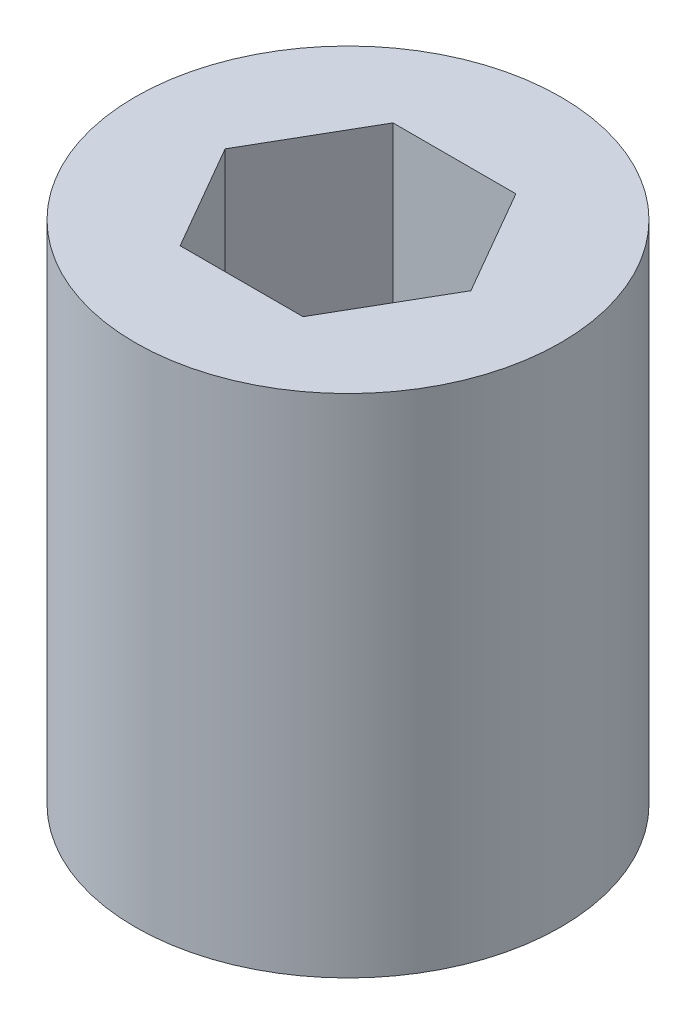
ISO-10303-21;
HEADER;
FILE_DESCRIPTION(('STEP AP214'),'2;1');
FILE_NAME('part.step','',(''),(''),'','','');
FILE_SCHEMA(('AUTOMOTIVE_DESIGN { 1 0 10303 214 1 1 1 1 }'));
ENDSEC;
DATA;
#1=APPLICATION_CONTEXT('core data for automotive mechanical design processes');
#2=APPLICATION_PROTOCOL_DEFINITION('international standard','automotive_design',2000,#1);
#3=PRODUCT_CONTEXT('',#1,'mechanical');
#4=PRODUCT('Part','Part','',(#3));
#5=PRODUCT_RELATED_PRODUCT_CATEGORY('part','',(#4));
#6=PRODUCT_DEFINITION_FORMATION('','',#4);
#7=PRODUCT_DEFINITION_CONTEXT('part definition',#1,'design');
#8=PRODUCT_DEFINITION('design','',#6,#7);
#9=PRODUCT_DEFINITION_SHAPE('','',#8);
#10=(LENGTH_UNIT() NAMED_UNIT(*) SI_UNIT(.MILLI.,.METRE.));
#11=(NAMED_UNIT(*) PLANE_ANGLE_UNIT() SI_UNIT($,.RADIAN.));
#12=(NAMED_UNIT(*) SI_UNIT($,.STERADIAN.) SOLID_ANGLE_UNIT());
#13=UNCERTAINTY_MEASURE_WITH_UNIT(LENGTH_MEASURE(1.E-05),#10,'distance_accuracy_value','');
#14=(GEOMETRIC_REPRESENTATION_CONTEXT(3) GLOBAL_UNCERTAINTY_ASSIGNED_CONTEXT((#13)) GLOBAL_UNIT_ASSIGNED_CONTEXT((#10,
#11,#12)) REPRESENTATION_CONTEXT('',''));
#15=CARTESIAN_POINT('',(0.,0.,0.));
#16=DIRECTION('',(0.,0.,1.));
#17=DIRECTION('',(1.,0.,0.));
#18=AXIS2_PLACEMENT_3D('',#15,#16,#17);
#19=CARTESIAN_POINT('',(0.,9.90721096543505,0.));
#20=DIRECTION('',(0.,1.,0.));
#21=DIRECTION('',(0.,0.,1.));
#22=AXIS2_PLACEMENT_3D('',#19,#20,#21);
#23=CYLINDRICAL_SURFACE('',#22,1.5);
#24=CARTESIAN_POINT('',(0.,0.,0.));
#25=DIRECTION('',(0.,1.,0.));
#26=DIRECTION('',(0.,0.,1.));
#27=AXIS2_PLACEMENT_3D('',#24,#25,#26);
#28=CIRCLE('',#27,1.5);
#29=CARTESIAN_POINT('',(0.,0.,1.5));
#30=VERTEX_POINT('',#29);
#31=EDGE_CURVE('E11',#30,#30,#28,.T.);
#32=ORIENTED_EDGE('',*,*,#31,.F.);
#33=EDGE_LOOP('',(#32));
#34=FACE_BOUND('',#33,.T.);
#35=CARTESIAN_POINT('',(0.,-3.56698729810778,0.));
#36=DIRECTION('',(0.,1.,0.));
#37=DIRECTION('',(0.,0.,1.));
#38=AXIS2_PLACEMENT_3D('',#35,#36,#37);
#39=CIRCLE('',#38,1.5);
#40=CARTESIAN_POINT('',(0.,-3.56698729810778,1.5));
#41=VERTEX_POINT('',#40);
#42=EDGE_CURVE('E140',#41,#41,#39,.T.);
#43=ORIENTED_EDGE('',*,*,#42,.T.);
#44=EDGE_LOOP('',(#43));
#45=FACE_BOUND('',#44,.T.);
#46=ADVANCED_FACE('F41',(#34,#45),#23,.T.);
#47=CARTESIAN_POINT('',(0.,0.,0.));
#48=DIRECTION('',(0.,-1.,0.));
#49=DIRECTION('',(0.,0.,-1.));
#50=AXIS2_PLACEMENT_3D('',#47,#48,#49);
#51=PLANE('',#50);
#52=DIRECTION('',(0.499999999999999,0.,-0.866025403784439));
#53=VECTOR('',#52,1.);
#54=CARTESIAN_POINT('',(0.433012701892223,0.,0.750000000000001));
#55=LINE('',#54,#53);
#56=CARTESIAN_POINT('',(0.433012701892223,0.,0.750000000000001));
#57=VERTEX_POINT('',#56);
#58=CARTESIAN_POINT('',(0.866025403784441,0.,0.));
#59=VERTEX_POINT('',#58);
#60=EDGE_CURVE('E128',#57,#59,#55,.T.);
#61=ORIENTED_EDGE('',*,*,#60,.F.);
#62=DIRECTION('',(1.,0.,0.));
#63=VECTOR('',#62,1.);
#64=CARTESIAN_POINT('',(0.433012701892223,0.,0.750000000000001));
#65=LINE('',#64,#63);
#66=CARTESIAN_POINT('',(-0.433012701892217,0.,0.75));
#67=VERTEX_POINT('',#66);
#68=EDGE_CURVE('E55',#67,#57,#65,.T.);
#69=ORIENTED_EDGE('',*,*,#68,.F.);
#70=DIRECTION('',(0.500000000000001,0.,0.866025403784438));
#71=VECTOR('',#70,1.);
#72=CARTESIAN_POINT('',(-0.866025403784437,0.,0.));
#73=LINE('',#72,#71);
#74=CARTESIAN_POINT('',(-0.866025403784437,0.,0.));
#75=VERTEX_POINT('',#74);
#76=EDGE_CURVE('E114',#75,#67,#73,.T.);
#77=ORIENTED_EDGE('',*,*,#76,.F.);
#78=DIRECTION('',(-0.500000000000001,0.,0.866025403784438));
#79=VECTOR('',#78,1.);
#80=CARTESIAN_POINT('',(-0.866025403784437,0.,0.));
#81=LINE('',#80,#79);
#82=CARTESIAN_POINT('',(-0.433012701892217,0.,-0.75));
#83=VERTEX_POINT('',#82);
#84=EDGE_CURVE('E117',#83,#75,#81,.T.);
#85=ORIENTED_EDGE('',*,*,#84,.F.);
#86=DIRECTION('',(-1.,0.,0.));
#87=VECTOR('',#86,1.);
#88=CARTESIAN_POINT('',(0.433012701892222,0.,-0.750000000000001));
#89=LINE('',#88,#87);
#90=CARTESIAN_POINT('',(0.433012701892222,0.,-0.750000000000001));
#91=VERTEX_POINT('',#90);
#92=EDGE_CURVE('E133',#91,#83,#89,.T.);
#93=ORIENTED_EDGE('',*,*,#92,.F.);
#94=DIRECTION('',(-0.499999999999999,0.,-0.866025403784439));
#95=VECTOR('',#94,1.);
#96=CARTESIAN_POINT('',(0.433012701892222,0.,-0.750000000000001));
#97=LINE('',#96,#95);
#98=EDGE_CURVE('E130',#59,#91,#97,.T.);
#99=ORIENTED_EDGE('',*,*,#98,.F.);
#100=EDGE_LOOP('',(#61,#69,#77,#85,#93,#99));
#101=FACE_BOUND('',#100,.T.);
#102=ORIENTED_EDGE('',*,*,#31,.T.);
#103=EDGE_LOOP('',(#102));
#104=FACE_BOUND('',#103,.T.);
#105=ADVANCED_FACE('F156',(#101,#104),#51,.F.);
#106=CARTESIAN_POINT('',(0.,-3.56698729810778,0.));
#107=DIRECTION('',(0.,-1.,0.));
#108=DIRECTION('',(0.,0.,-1.));
#109=AXIS2_PLACEMENT_3D('',#106,#107,#108);
#110=CONICAL_SURFACE('',#109,0.,1.0471975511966);
#111=CARTESIAN_POINT('',(0.,-4.,0.));
#112=DIRECTION('',(0.,1.,0.));
#113=DIRECTION('',(0.,0.,1.));
#114=AXIS2_PLACEMENT_3D('',#111,#112,#113);
#115=CIRCLE('',#114,0.750000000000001);
#116=CARTESIAN_POINT('',(0.,-4.,0.750000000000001));
#117=VERTEX_POINT('',#116);
#118=EDGE_CURVE('E48',#117,#117,#115,.T.);
#119=ORIENTED_EDGE('',*,*,#118,.F.);
#120=EDGE_LOOP('',(#119));
#121=FACE_BOUND('',#120,.T.);
#122=CARTESIAN_POINT('',(0.,-3.56698729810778,0.));
#123=VERTEX_POINT('',#122);
#124=VERTEX_LOOP('',#123);
#125=FACE_BOUND('',#124,.T.);
#126=ADVANCED_FACE('F154',(#121,#125),#110,.F.);
#127=CARTESIAN_POINT('',(0.,-4.,0.));
#128=DIRECTION('',(0.,1.,0.));
#129=DIRECTION('',(0.,0.,1.));
#130=AXIS2_PLACEMENT_3D('',#127,#128,#129);
#131=CONICAL_SURFACE('',#130,0.750000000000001,1.0471975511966);
#132=ORIENTED_EDGE('',*,*,#42,.F.);
#133=EDGE_LOOP('',(#132));
#134=FACE_BOUND('',#133,.T.);
#135=ORIENTED_EDGE('',*,*,#118,.T.);
#136=EDGE_LOOP('',(#135));
#137=FACE_BOUND('',#136,.T.);
#138=ADVANCED_FACE('F152',(#134,#137),#131,.T.);
#139=CARTESIAN_POINT('',(0.433012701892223,-1.5,0.750000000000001));
#140=DIRECTION('',(0.,0.,1.));
#141=DIRECTION('',(1.,0.,0.));
#142=AXIS2_PLACEMENT_3D('',#139,#140,#141);
#143=PLANE('',#142);
#144=ORIENTED_EDGE('',*,*,#68,.T.);
#145=DIRECTION('',(0.,1.,0.));
#146=VECTOR('',#145,1.);
#147=CARTESIAN_POINT('',(0.433012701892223,-1.5,0.750000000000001));
#148=LINE('',#147,#146);
#149=CARTESIAN_POINT('',(0.433012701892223,-1.5,0.750000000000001));
#150=VERTEX_POINT('',#149);
#151=EDGE_CURVE('E91',#150,#57,#148,.T.);
#152=ORIENTED_EDGE('',*,*,#151,.F.);
#153=DIRECTION('',(1.,0.,0.));
#154=VECTOR('',#153,1.);
#155=CARTESIAN_POINT('',(0.433012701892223,-1.5,0.750000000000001));
#156=LINE('',#155,#154);
#157=CARTESIAN_POINT('',(-0.433012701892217,-1.5,0.75));
#158=VERTEX_POINT('',#157);
#159=EDGE_CURVE('E95',#158,#150,#156,.T.);
#160=ORIENTED_EDGE('',*,*,#159,.F.);
#161=DIRECTION('',(0.,1.,0.));
#162=VECTOR('',#161,1.);
#163=CARTESIAN_POINT('',(-0.433012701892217,-1.5,0.75));
#164=LINE('',#163,#162);
#165=EDGE_CURVE('E138',#158,#67,#164,.T.);
#166=ORIENTED_EDGE('',*,*,#165,.T.);
#167=EDGE_LOOP('',(#144,#152,#160,#166));
#168=FACE_BOUND('',#167,.T.);
#169=ADVANCED_FACE('F93',(#168),#143,.F.);
#170=CARTESIAN_POINT('',(-0.866025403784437,-1.5,0.));
#171=DIRECTION('',(-0.866025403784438,0.,0.500000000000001));
#172=DIRECTION('',(0.500000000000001,0.,0.866025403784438));
#173=AXIS2_PLACEMENT_3D('',#170,#171,#172);
#174=PLANE('',#173);
#175=ORIENTED_EDGE('',*,*,#76,.T.);
#176=ORIENTED_EDGE('',*,*,#165,.F.);
#177=DIRECTION('',(0.500000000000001,0.,0.866025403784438));
#178=VECTOR('',#177,1.);
#179=CARTESIAN_POINT('',(-0.866025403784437,-1.5,0.));
#180=LINE('',#179,#178);
#181=CARTESIAN_POINT('',(-0.866025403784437,-1.5,0.));
#182=VERTEX_POINT('',#181);
#183=EDGE_CURVE('E101',#182,#158,#180,.T.);
#184=ORIENTED_EDGE('',*,*,#183,.F.);
#185=DIRECTION('',(0.,1.,0.));
#186=VECTOR('',#185,1.);
#187=CARTESIAN_POINT('',(-0.866025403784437,-1.5,0.));
#188=LINE('',#187,#186);
#189=EDGE_CURVE('E141',#182,#75,#188,.T.);
#190=ORIENTED_EDGE('',*,*,#189,.T.);
#191=EDGE_LOOP('',(#175,#176,#184,#190));
#192=FACE_BOUND('',#191,.T.);
#193=ADVANCED_FACE('F199',(#192),#174,.F.);
#194=CARTESIAN_POINT('',(-0.866025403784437,-1.5,0.));
#195=DIRECTION('',(-0.866025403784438,0.,-0.500000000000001));
#196=DIRECTION('',(-0.500000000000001,0.,0.866025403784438));
#197=AXIS2_PLACEMENT_3D('',#194,#195,#196);
#198=PLANE('',#197);
#199=ORIENTED_EDGE('',*,*,#84,.T.);
#200=ORIENTED_EDGE('',*,*,#189,.F.);
#201=DIRECTION('',(-0.500000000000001,0.,0.866025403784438));
#202=VECTOR('',#201,1.);
#203=CARTESIAN_POINT('',(-0.866025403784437,-1.5,0.));
#204=LINE('',#203,#202);
#205=CARTESIAN_POINT('',(-0.433012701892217,-1.5,-0.75));
#206=VERTEX_POINT('',#205);
#207=EDGE_CURVE('E124',#206,#182,#204,.T.);
#208=ORIENTED_EDGE('',*,*,#207,.F.);
#209=DIRECTION('',(0.,1.,0.));
#210=VECTOR('',#209,1.);
#211=CARTESIAN_POINT('',(-0.433012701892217,-1.5,-0.75));
#212=LINE('',#211,#210);
#213=EDGE_CURVE('E143',#206,#83,#212,.T.);
#214=ORIENTED_EDGE('',*,*,#213,.T.);
#215=EDGE_LOOP('',(#199,#200,#208,#214));
#216=FACE_BOUND('',#215,.T.);
#217=ADVANCED_FACE('F208',(#216),#198,.F.);
#218=CARTESIAN_POINT('',(0.433012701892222,-1.5,-0.750000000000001));
#219=DIRECTION('',(0.,0.,-1.));
#220=DIRECTION('',(-1.,0.,0.));
#221=AXIS2_PLACEMENT_3D('',#218,#219,#220);
#222=PLANE('',#221);
#223=ORIENTED_EDGE('',*,*,#92,.T.);
#224=ORIENTED_EDGE('',*,*,#213,.F.);
#225=DIRECTION('',(-1.,0.,0.));
#226=VECTOR('',#225,1.);
#227=CARTESIAN_POINT('',(0.433012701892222,-1.5,-0.750000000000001));
#228=LINE('',#227,#226);
#229=CARTESIAN_POINT('',(0.433012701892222,-1.5,-0.750000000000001));
#230=VERTEX_POINT('',#229);
#231=EDGE_CURVE('E121',#230,#206,#228,.T.);
#232=ORIENTED_EDGE('',*,*,#231,.F.);
#233=DIRECTION('',(0.,1.,0.));
#234=VECTOR('',#233,1.);
#235=CARTESIAN_POINT('',(0.433012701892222,-1.5,-0.750000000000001));
#236=LINE('',#235,#234);
#237=EDGE_CURVE('E145',#230,#91,#236,.T.);
#238=ORIENTED_EDGE('',*,*,#237,.T.);
#239=EDGE_LOOP('',(#223,#224,#232,#238));
#240=FACE_BOUND('',#239,.T.);
#241=ADVANCED_FACE('F218',(#240),#222,.F.);
#242=CARTESIAN_POINT('',(0.433012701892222,-1.5,-0.750000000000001));
#243=DIRECTION('',(0.866025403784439,0.,-0.499999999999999));
#244=DIRECTION('',(-0.499999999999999,0.,-0.866025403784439));
#245=AXIS2_PLACEMENT_3D('',#242,#243,#244);
#246=PLANE('',#245);
#247=ORIENTED_EDGE('',*,*,#98,.T.);
#248=ORIENTED_EDGE('',*,*,#237,.F.);
#249=DIRECTION('',(-0.499999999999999,0.,-0.866025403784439));
#250=VECTOR('',#249,1.);
#251=CARTESIAN_POINT('',(0.433012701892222,-1.5,-0.750000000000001));
#252=LINE('',#251,#250);
#253=CARTESIAN_POINT('',(0.866025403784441,-1.5,0.));
#254=VERTEX_POINT('',#253);
#255=EDGE_CURVE('E109',#254,#230,#252,.T.);
#256=ORIENTED_EDGE('',*,*,#255,.F.);
#257=DIRECTION('',(0.,1.,0.));
#258=VECTOR('',#257,1.);
#259=CARTESIAN_POINT('',(0.866025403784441,-1.5,0.));
#260=LINE('',#259,#258);
#261=EDGE_CURVE('E100',#254,#59,#260,.T.);
#262=ORIENTED_EDGE('',*,*,#261,.T.);
#263=EDGE_LOOP('',(#247,#248,#256,#262));
#264=FACE_BOUND('',#263,.T.);
#265=ADVANCED_FACE('F228',(#264),#246,.F.);
#266=CARTESIAN_POINT('',(0.433012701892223,-1.5,0.750000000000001));
#267=DIRECTION('',(0.866025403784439,0.,0.499999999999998));
#268=DIRECTION('',(0.499999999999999,0.,-0.86602540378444));
#269=AXIS2_PLACEMENT_3D('',#266,#267,#268);
#270=PLANE('',#269);
#271=ORIENTED_EDGE('',*,*,#60,.T.);
#272=ORIENTED_EDGE('',*,*,#261,.F.);
#273=DIRECTION('',(0.499999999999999,0.,-0.866025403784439));
#274=VECTOR('',#273,1.);
#275=CARTESIAN_POINT('',(0.433012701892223,-1.5,0.750000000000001));
#276=LINE('',#275,#274);
#277=EDGE_CURVE('E104',#150,#254,#276,.T.);
#278=ORIENTED_EDGE('',*,*,#277,.F.);
#279=ORIENTED_EDGE('',*,*,#151,.T.);
#280=EDGE_LOOP('',(#271,#272,#278,#279));
#281=FACE_BOUND('',#280,.T.);
#282=ADVANCED_FACE('F105',(#281),#270,.F.);
#283=CARTESIAN_POINT('',(0.433012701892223,-1.5,0.750000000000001));
#284=DIRECTION('',(0.,-1.,0.));
#285=DIRECTION('',(0.,0.,-1.));
#286=AXIS2_PLACEMENT_3D('',#283,#284,#285);
#287=PLANE('',#286);
#288=ORIENTED_EDGE('',*,*,#159,.T.);
#289=ORIENTED_EDGE('',*,*,#277,.T.);
#290=ORIENTED_EDGE('',*,*,#255,.T.);
#291=ORIENTED_EDGE('',*,*,#231,.T.);
#292=ORIENTED_EDGE('',*,*,#207,.T.);
#293=ORIENTED_EDGE('',*,*,#183,.T.);
#294=EDGE_LOOP('',(#288,#289,#290,#291,#292,#293));
#295=FACE_BOUND('',#294,.T.);
#296=ADVANCED_FACE('F111',(#295),#287,.F.);
#297=CLOSED_SHELL('',(#46,#105,#126,#138,#169,#193,#217,#241,#265,#282,#296));
#298=MANIFOLD_SOLID_BREP('B2',#297);
#299=ADVANCED_BREP_SHAPE_REPRESENTATION('',(#18,#298),#14);
#300=SHAPE_DEFINITION_REPRESENTATION(#9,#299);
ENDSEC;
END-ISO-10303-21;
